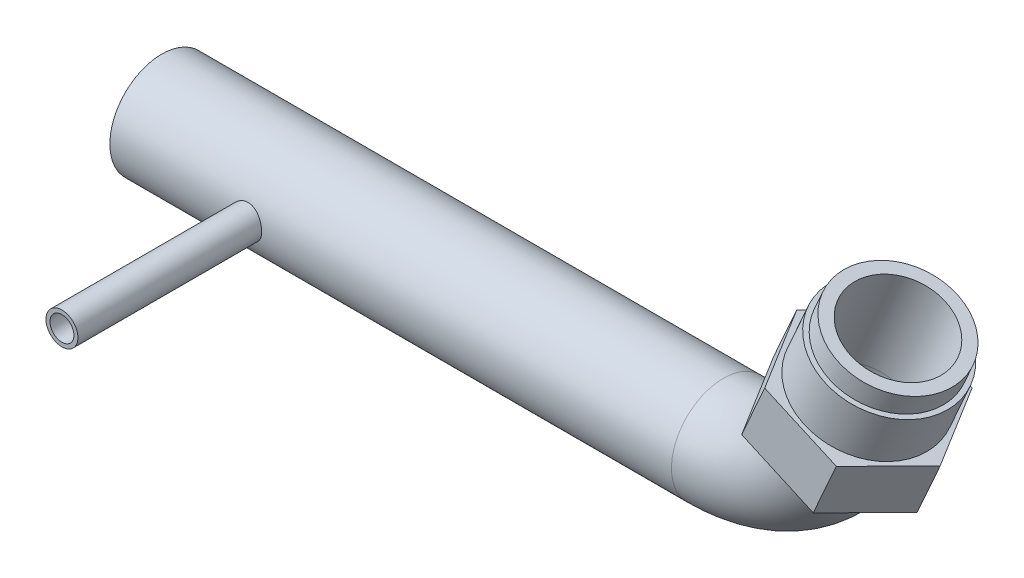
ISO-10303-21;
HEADER;
FILE_DESCRIPTION(('STEP AP214'),'2;1');
FILE_NAME('part.step','',(''),(''),'','','');
FILE_SCHEMA(('AUTOMOTIVE_DESIGN { 1 0 10303 214 1 1 1 1 }'));
ENDSEC;
DATA;
#1=APPLICATION_CONTEXT('core data for automotive mechanical design processes');
#2=APPLICATION_PROTOCOL_DEFINITION('international standard','automotive_design',2000,#1);
#3=PRODUCT_CONTEXT('',#1,'mechanical');
#4=PRODUCT('Part','Part','',(#3));
#5=PRODUCT_RELATED_PRODUCT_CATEGORY('part','',(#4));
#6=PRODUCT_DEFINITION_FORMATION('','',#4);
#7=PRODUCT_DEFINITION_CONTEXT('part definition',#1,'design');
#8=PRODUCT_DEFINITION('design','',#6,#7);
#9=PRODUCT_DEFINITION_SHAPE('','',#8);
#10=(LENGTH_UNIT() NAMED_UNIT(*) SI_UNIT(.MILLI.,.METRE.));
#11=(NAMED_UNIT(*) PLANE_ANGLE_UNIT() SI_UNIT($,.RADIAN.));
#12=(NAMED_UNIT(*) SI_UNIT($,.STERADIAN.) SOLID_ANGLE_UNIT());
#13=UNCERTAINTY_MEASURE_WITH_UNIT(LENGTH_MEASURE(1.E-05),#10,'distance_accuracy_value','');
#14=(GEOMETRIC_REPRESENTATION_CONTEXT(3) GLOBAL_UNCERTAINTY_ASSIGNED_CONTEXT((#13)) GLOBAL_UNIT_ASSIGNED_CONTEXT((#10,
#11,#12)) REPRESENTATION_CONTEXT('',''));
#15=CARTESIAN_POINT('',(0.,0.,0.));
#16=DIRECTION('',(0.,0.,1.));
#17=DIRECTION('',(1.,0.,0.));
#18=AXIS2_PLACEMENT_3D('',#15,#16,#17);
#19=CARTESIAN_POINT('',(85.5792824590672,8.03920002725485,0.));
#20=DIRECTION('',(0.40673664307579,0.913545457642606,0.));
#21=DIRECTION('',(-0.913545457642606,0.40673664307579,0.));
#22=AXIS2_PLACEMENT_3D('',#19,#20,#21);
#23=CYLINDRICAL_SURFACE('',#22,6.99999999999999);
#24=CARTESIAN_POINT('',(88.4671126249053,14.5253727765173,0.));
#25=DIRECTION('',(-0.40673664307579,-0.913545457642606,0.));
#26=DIRECTION('',(0.913545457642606,-0.40673664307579,0.));
#27=AXIS2_PLACEMENT_3D('',#24,#25,#26);
#28=CIRCLE('',#27,6.99999999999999);
#29=CARTESIAN_POINT('',(94.8619308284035,11.6782162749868,0.));
#30=VERTEX_POINT('',#29);
#31=EDGE_CURVE('E11',#30,#30,#28,.F.);
#32=ORIENTED_EDGE('',*,*,#31,.T.);
#33=EDGE_LOOP('',(#32));
#34=FACE_BOUND('',#33,.T.);
#35=CARTESIAN_POINT('',(87.6129656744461,12.6069273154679,0.));
#36=DIRECTION('',(-0.406736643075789,-0.913545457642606,0.));
#37=DIRECTION('',(0.913545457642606,-0.406736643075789,0.));
#38=AXIS2_PLACEMENT_3D('',#35,#36,#37);
#39=CIRCLE('',#38,7.);
#40=CARTESIAN_POINT('',(94.0077838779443,9.75977081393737,0.));
#41=VERTEX_POINT('',#40);
#42=EDGE_CURVE('E464',#41,#41,#39,.T.);
#43=ORIENTED_EDGE('',*,*,#42,.T.);
#44=EDGE_LOOP('',(#43));
#45=FACE_BOUND('',#44,.T.);
#46=ADVANCED_FACE('F32',(#34,#45),#23,.F.);
#47=CARTESIAN_POINT('',(86.7544815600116,10.6787404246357,0.));
#48=DIRECTION('',(0.406736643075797,0.913545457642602,0.));
#49=DIRECTION('',(-0.913545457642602,0.406736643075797,0.));
#50=AXIS2_PLACEMENT_3D('',#47,#48,#49);
#51=CYLINDRICAL_SURFACE('',#50,6.5);
#52=CARTESIAN_POINT('',(86.7544815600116,10.6787404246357,0.));
#53=DIRECTION('',(0.406736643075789,0.913545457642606,0.));
#54=DIRECTION('',(0.,0.,-1.));
#55=AXIS2_PLACEMENT_3D('',#52,#53,#54);
#56=CIRCLE('',#55,6.5);
#57=CARTESIAN_POINT('',(92.6925270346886,8.03495224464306,0.));
#58=VERTEX_POINT('',#57);
#59=EDGE_CURVE('E174',#58,#58,#56,.T.);
#60=ORIENTED_EDGE('',*,*,#59,.T.);
#61=EDGE_LOOP('',(#60));
#62=FACE_BOUND('',#61,.T.);
#63=CARTESIAN_POINT('',(91.0702271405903,20.3720637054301,0.));
#64=DIRECTION('',(0.40673664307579,0.913545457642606,0.));
#65=DIRECTION('',(-0.913545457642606,0.40673664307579,0.));
#66=AXIS2_PLACEMENT_3D('',#63,#64,#65);
#67=CIRCLE('',#66,6.5);
#68=CARTESIAN_POINT('',(85.1321816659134,23.0158518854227,0.));
#69=VERTEX_POINT('',#68);
#70=EDGE_CURVE('E156',#69,#69,#67,.F.);
#71=ORIENTED_EDGE('',*,*,#70,.T.);
#72=EDGE_LOOP('',(#71));
#73=FACE_BOUND('',#72,.T.);
#74=ADVANCED_FACE('F34',(#62,#73),#51,.T.);
#75=CARTESIAN_POINT('',(86.7544815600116,10.6787404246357,0.));
#76=DIRECTION('',(0.406736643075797,0.913545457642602,0.));
#77=DIRECTION('',(-0.913545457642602,0.406736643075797,0.));
#78=AXIS2_PLACEMENT_3D('',#75,#76,#77);
#79=CYLINDRICAL_SURFACE('',#78,5.9);
#80=CARTESIAN_POINT('',(92.1684160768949,22.8386364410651,0.));
#81=DIRECTION('',(0.406736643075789,0.913545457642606,0.));
#82=DIRECTION('',(0.,0.,-1.));
#83=AXIS2_PLACEMENT_3D('',#80,#81,#82);
#84=CIRCLE('',#83,5.9);
#85=CARTESIAN_POINT('',(92.1684160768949,22.8386364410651,-5.9));
#86=VERTEX_POINT('',#85);
#87=EDGE_CURVE('E41',#86,#86,#84,.T.);
#88=ORIENTED_EDGE('',*,*,#87,.T.);
#89=EDGE_LOOP('',(#88));
#90=FACE_BOUND('',#89,.T.);
#91=CARTESIAN_POINT('',(86.7544815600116,10.6787404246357,0.));
#92=DIRECTION('',(0.406736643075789,0.913545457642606,0.));
#93=DIRECTION('',(0.,0.,-1.));
#94=AXIS2_PLACEMENT_3D('',#91,#92,#93);
#95=CIRCLE('',#94,5.9);
#96=CARTESIAN_POINT('',(92.144399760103,8.27899423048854,0.));
#97=VERTEX_POINT('',#96);
#98=EDGE_CURVE('E167',#97,#97,#95,.T.);
#99=ORIENTED_EDGE('',*,*,#98,.F.);
#100=EDGE_LOOP('',(#99));
#101=FACE_BOUND('',#100,.T.);
#102=ADVANCED_FACE('F179',(#90,#101),#79,.F.);
#103=CARTESIAN_POINT('',(70.3106633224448,18.,0.));
#104=DIRECTION('',(0.,0.,1.));
#105=DIRECTION('',(1.,0.,0.));
#106=AXIS2_PLACEMENT_3D('',#103,#104,#105);
#107=TOROIDAL_SURFACE('',#106,18.,6.5);
#108=CARTESIAN_POINT('',(70.3106633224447,0.,0.));
#109=DIRECTION('',(1.,0.,0.));
#110=DIRECTION('',(0.,0.,-1.));
#111=AXIS2_PLACEMENT_3D('',#108,#109,#110);
#112=CIRCLE('',#111,6.5);
#113=CARTESIAN_POINT('',(70.3106633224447,-6.5,0.));
#114=VERTEX_POINT('',#113);
#115=EDGE_CURVE('E163',#114,#114,#112,.T.);
#116=CARTESIAN_POINT('',(70.3106633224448,18.,0.));
#117=DIRECTION('',(0.,0.,1.));
#118=DIRECTION('',(1.,0.,0.));
#119=AXIS2_PLACEMENT_3D('',#116,#117,#118);
#120=CIRCLE('',#119,24.5);
#121=EDGE_CURVE('',#114,#58,#120,.T.);
#122=ORIENTED_EDGE('',*,*,#115,.T.);
#123=ORIENTED_EDGE('',*,*,#59,.F.);
#124=ORIENTED_EDGE('',*,*,#121,.T.);
#125=ORIENTED_EDGE('',*,*,#121,.F.);
#126=EDGE_LOOP('',(#122,#124,#123,#125));
#127=FACE_BOUND('',#126,.T.);
#128=ADVANCED_FACE('F421',(#127),#107,.T.);
#129=CARTESIAN_POINT('',(70.3106633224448,18.,0.));
#130=DIRECTION('',(0.,0.,1.));
#131=DIRECTION('',(1.,0.,0.));
#132=AXIS2_PLACEMENT_3D('',#129,#130,#131);
#133=TOROIDAL_SURFACE('',#132,18.,5.9);
#134=CARTESIAN_POINT('',(70.3106633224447,0.,0.));
#135=DIRECTION('',(1.,0.,0.));
#136=DIRECTION('',(0.,0.,-1.));
#137=AXIS2_PLACEMENT_3D('',#134,#135,#136);
#138=CIRCLE('',#137,5.9);
#139=CARTESIAN_POINT('',(70.3106633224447,-5.9,0.));
#140=VERTEX_POINT('',#139);
#141=EDGE_CURVE('E160',#140,#140,#138,.T.);
#142=CARTESIAN_POINT('',(70.3106633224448,18.,0.));
#143=DIRECTION('',(0.,0.,1.));
#144=DIRECTION('',(1.,0.,0.));
#145=AXIS2_PLACEMENT_3D('',#142,#143,#144);
#146=CIRCLE('',#145,23.9);
#147=EDGE_CURVE('',#140,#97,#146,.T.);
#148=ORIENTED_EDGE('',*,*,#141,.F.);
#149=ORIENTED_EDGE('',*,*,#98,.T.);
#150=ORIENTED_EDGE('',*,*,#147,.T.);
#151=ORIENTED_EDGE('',*,*,#147,.F.);
#152=EDGE_LOOP('',(#148,#150,#149,#151));
#153=FACE_BOUND('',#152,.T.);
#154=ADVANCED_FACE('F415',(#153),#133,.F.);
#155=CARTESIAN_POINT('',(70.3106633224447,0.,0.));
#156=DIRECTION('',(-1.,0.,0.));
#157=DIRECTION('',(0.,0.,1.));
#158=AXIS2_PLACEMENT_3D('',#155,#156,#157);
#159=CYLINDRICAL_SURFACE('',#158,5.9);
#160=CARTESIAN_POINT('',(18.5,0.,5.9));
#161=CARTESIAN_POINT('',(18.4999977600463,0.0828300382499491,5.89999863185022));
#162=CARTESIAN_POINT('',(18.4931161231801,0.165684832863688,5.89823839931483));
#163=CARTESIAN_POINT('',(18.4658144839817,0.329016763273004,5.89138713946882));
#164=CARTESIAN_POINT('',(18.4453870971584,0.409492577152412,5.88629429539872));
#165=CARTESIAN_POINT('',(18.391694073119,0.565684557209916,5.87334130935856));
#166=CARTESIAN_POINT('',(18.3584441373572,0.641406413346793,5.86548455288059));
#167=CARTESIAN_POINT('',(18.2801058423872,0.786197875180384,5.84783888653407));
#168=CARTESIAN_POINT('',(18.2350169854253,0.855267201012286,5.83804989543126));
#169=CARTESIAN_POINT('',(18.1332691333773,0.986260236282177,5.81736852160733));
#170=CARTESIAN_POINT('',(18.0764058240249,1.04802249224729,5.80645865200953));
#171=CARTESIAN_POINT('',(17.9531604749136,1.16124449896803,5.78488032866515));
#172=CARTESIAN_POINT('',(17.886777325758,1.21270304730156,5.77421190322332));
#173=CARTESIAN_POINT('',(17.7451143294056,1.30462316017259,5.75414745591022));
#174=CARTESIAN_POINT('',(17.6697130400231,1.34490284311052,5.74477360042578));
#175=CARTESIAN_POINT('',(17.5129323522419,1.4121517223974,5.72861518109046));
#176=CARTESIAN_POINT('',(17.4315539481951,1.43912312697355,5.72183018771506));
#177=CARTESIAN_POINT('',(17.2669076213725,1.47843656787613,5.71179764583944));
#178=CARTESIAN_POINT('',(17.1837135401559,1.49106951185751,5.70847986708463));
#179=CARTESIAN_POINT('',(17.0163258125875,1.5022537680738,5.70554728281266));
#180=CARTESIAN_POINT('',(16.9321323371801,1.50080745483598,5.70593185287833));
#181=CARTESIAN_POINT('',(16.7673754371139,1.48410606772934,5.71029745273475));
#182=CARTESIAN_POINT('',(16.6867739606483,1.46919896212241,5.71418785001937));
#183=CARTESIAN_POINT('',(16.5292552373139,1.42655478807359,5.72498214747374));
#184=CARTESIAN_POINT('',(16.4523382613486,1.39881677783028,5.73188626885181));
#185=CARTESIAN_POINT('',(16.3034453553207,1.33100488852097,5.74801240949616));
#186=CARTESIAN_POINT('',(16.2315290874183,1.29080579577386,5.75725777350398));
#187=CARTESIAN_POINT('',(16.0953387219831,1.19930036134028,5.77701165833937));
#188=CARTESIAN_POINT('',(16.0310660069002,1.14799201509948,5.78752040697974));
#189=CARTESIAN_POINT('',(15.9099946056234,1.03392786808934,5.80899752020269));
#190=CARTESIAN_POINT('',(15.8534726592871,0.97087877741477,5.81997029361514));
#191=CARTESIAN_POINT('',(15.7517506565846,0.836064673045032,5.84085966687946));
#192=CARTESIAN_POINT('',(15.7065509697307,0.764299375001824,5.85077623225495));
#193=CARTESIAN_POINT('',(15.6286499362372,0.613686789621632,5.86848800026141));
#194=CARTESIAN_POINT('',(15.5959948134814,0.534814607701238,5.87627532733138));
#195=CARTESIAN_POINT('',(15.5444848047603,0.372457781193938,5.888794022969));
#196=CARTESIAN_POINT('',(15.5256271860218,0.288974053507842,5.89352599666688));
#197=CARTESIAN_POINT('',(15.5026730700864,0.122128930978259,5.899310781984));
#198=CARTESIAN_POINT('',(15.4981998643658,0.0388225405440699,5.90045746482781));
#199=CARTESIAN_POINT('',(15.5031065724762,-0.127348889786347,5.89921045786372));
#200=CARTESIAN_POINT('',(15.5124851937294,-0.210213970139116,5.89681709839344));
#201=CARTESIAN_POINT('',(15.5445191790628,-0.371832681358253,5.88881920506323));
#202=CARTESIAN_POINT('',(15.566967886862,-0.450629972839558,5.88326468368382));
#203=CARTESIAN_POINT('',(15.6242677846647,-0.603335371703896,5.86957144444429));
#204=CARTESIAN_POINT('',(15.6591202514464,-0.677242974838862,5.8614324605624));
#205=CARTESIAN_POINT('',(15.7409605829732,-0.819561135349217,5.84324947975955));
#206=CARTESIAN_POINT('',(15.7881579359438,-0.887847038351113,5.83317348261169));
#207=CARTESIAN_POINT('',(15.893081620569,-1.01566287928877,5.81228271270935));
#208=CARTESIAN_POINT('',(15.9508098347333,-1.07519124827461,5.80146780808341));
#209=CARTESIAN_POINT('',(16.0769079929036,-1.18536341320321,5.77997834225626));
#210=CARTESIAN_POINT('',(16.145511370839,-1.23574255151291,5.76931435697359));
#211=CARTESIAN_POINT('',(16.2904196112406,-1.32427465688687,5.74964010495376));
#212=CARTESIAN_POINT('',(16.3667241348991,-1.36242816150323,5.74062976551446));
#213=CARTESIAN_POINT('',(16.524464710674,-1.42514033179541,5.72538357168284));
#214=CARTESIAN_POINT('',(16.6058671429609,-1.44977937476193,5.71913135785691));
#215=CARTESIAN_POINT('',(16.7718431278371,-1.484970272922,5.71009628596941));
#216=CARTESIAN_POINT('',(16.8564159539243,-1.49552533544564,5.70731263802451));
#217=CARTESIAN_POINT('',(17.0236348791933,-1.50207678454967,5.70559153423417));
#218=CARTESIAN_POINT('',(17.1062634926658,-1.49849674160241,5.70654217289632));
#219=CARTESIAN_POINT('',(17.2696972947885,-1.47785227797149,5.71192298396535));
#220=CARTESIAN_POINT('',(17.3505025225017,-1.4607881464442,5.71635308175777));
#221=CARTESIAN_POINT('',(17.5075172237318,-1.41389485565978,5.72813020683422));
#222=CARTESIAN_POINT('',(17.5837526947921,-1.38414770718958,5.73545847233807));
#223=CARTESIAN_POINT('',(17.7302060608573,-1.3127973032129,5.75220828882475));
#224=CARTESIAN_POINT('',(17.8004230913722,-1.27119234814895,5.76163013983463));
#225=CARTESIAN_POINT('',(17.9348870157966,-1.17599044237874,5.78182245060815));
#226=CARTESIAN_POINT('',(17.9989222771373,-1.12210078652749,5.79262238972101));
#227=CARTESIAN_POINT('',(18.1171786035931,-1.00442620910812,5.81418091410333));
#228=CARTESIAN_POINT('',(18.1713973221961,-0.940638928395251,5.82493948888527));
#229=CARTESIAN_POINT('',(18.2694831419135,-0.803524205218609,5.84544595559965));
#230=CARTESIAN_POINT('',(18.3131351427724,-0.730039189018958,5.8551708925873));
#231=CARTESIAN_POINT('',(18.387396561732,-0.576532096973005,5.8722700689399));
#232=CARTESIAN_POINT('',(18.4180150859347,-0.49651463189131,5.87964594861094));
#233=CARTESIAN_POINT('',(18.4609314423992,-0.347230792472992,5.89015920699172));
#234=CARTESIAN_POINT('',(18.4755499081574,-0.278659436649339,5.89382377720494));
#235=CARTESIAN_POINT('',(18.4950847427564,-0.140064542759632,5.89874465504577));
#236=CARTESIAN_POINT('',(18.500001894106,-0.0700411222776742,5.90000115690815));
#237=CARTESIAN_POINT('',(18.5,0.,5.9));
#238=B_SPLINE_CURVE_WITH_KNOTS('',3,(#160,#161,#162,#163,#164,#165,#166,#167,#168,#169,#170,
#171,#172,#173,#174,#175,#176,#177,#178,#179,#180,#181,#182,#183,#184,#185,#186,#187,#188,#189,
#190,#191,#192,#193,#194,#195,#196,#197,#198,#199,#200,#201,#202,#203,#204,#205,#206,#207,#208,
#209,#210,#211,#212,#213,#214,#215,#216,#217,#218,#219,#220,#221,#222,#223,#224,#225,#226,#227,
#228,#229,#230,#231,#232,#233,#234,#235,#236,#237),.UNSPECIFIED.,.T.,.F.,(4,2,2,2,2,2,2,2,2,2,2,
2,2,2,2,2,2,2,2,2,2,2,2,2,2,2,2,2,2,2,2,2,2,2,2,2,2,2,4),(0.,0.248233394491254,
0.496602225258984,0.744667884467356,0.992743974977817,1.2455526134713,1.49839073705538,
1.75512908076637,2.01182480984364,2.26321383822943,2.51456046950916,2.7595900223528,
3.00463756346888,3.25223194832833,3.4998710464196,3.75482258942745,4.00978245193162,
4.26567297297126,4.52151279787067,4.77059551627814,5.01965499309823,5.26487950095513,
5.51012925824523,5.7598463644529,6.00960815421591,6.26572614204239,6.52183286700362,
6.77639940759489,7.03090796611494,7.27784869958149,7.52478413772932,7.77014649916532,
8.01554404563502,8.26754847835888,8.51961307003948,8.77644345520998,9.03309410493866,
9.24301732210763,9.45292360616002),.UNSPECIFIED.);
#239=CARTESIAN_POINT('',(18.5,0.,5.9));
#240=VERTEX_POINT('',#239);
#241=EDGE_CURVE('E471',#240,#240,#238,.T.);
#242=ORIENTED_EDGE('',*,*,#241,.T.);
#243=EDGE_LOOP('',(#242));
#244=FACE_BOUND('',#243,.T.);
#245=ORIENTED_EDGE('',*,*,#141,.T.);
#246=EDGE_LOOP('',(#245));
#247=FACE_BOUND('',#246,.T.);
#248=CARTESIAN_POINT('',(0.,0.,0.));
#249=DIRECTION('',(1.,0.,0.));
#250=DIRECTION('',(0.,0.,-1.));
#251=AXIS2_PLACEMENT_3D('',#248,#249,#250);
#252=CIRCLE('',#251,5.9);
#253=CARTESIAN_POINT('',(0.,0.,-5.9));
#254=VERTEX_POINT('',#253);
#255=EDGE_CURVE('E159',#254,#254,#252,.T.);
#256=ORIENTED_EDGE('',*,*,#255,.F.);
#257=EDGE_LOOP('',(#256));
#258=FACE_BOUND('',#257,.T.);
#259=ADVANCED_FACE('F420',(#244,#247,#258),#159,.F.);
#260=CARTESIAN_POINT('',(70.3106633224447,0.,0.));
#261=DIRECTION('',(-1.,0.,0.));
#262=DIRECTION('',(0.,0.,1.));
#263=AXIS2_PLACEMENT_3D('',#260,#261,#262);
#264=CYLINDRICAL_SURFACE('',#263,6.5);
#265=CARTESIAN_POINT('',(19.,0.,6.5));
#266=CARTESIAN_POINT('',(18.999999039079,0.10958647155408,6.49999929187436));
#267=CARTESIAN_POINT('',(18.9909633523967,0.219182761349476,6.49720235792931));
#268=CARTESIAN_POINT('',(18.9551505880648,0.435175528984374,6.48631855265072));
#269=CARTESIAN_POINT('',(18.9283690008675,0.541571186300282,6.47823033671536));
#270=CARTESIAN_POINT('',(18.8580492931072,0.748016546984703,6.45764858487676));
#271=CARTESIAN_POINT('',(18.8145366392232,0.848075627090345,6.44516174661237));
#272=CARTESIAN_POINT('',(18.7120967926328,1.03947745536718,6.4170753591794));
#273=CARTESIAN_POINT('',(18.6531673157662,1.13081890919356,6.40147534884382));
#274=CARTESIAN_POINT('',(18.5197023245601,1.30493699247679,6.36829752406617));
#275=CARTESIAN_POINT('',(18.4447875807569,1.38741488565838,6.35067760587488));
#276=CARTESIAN_POINT('',(18.282286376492,1.53885708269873,6.31569252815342));
#277=CARTESIAN_POINT('',(18.1946976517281,1.60781896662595,6.29832741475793));
#278=CARTESIAN_POINT('',(18.0067713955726,1.73187276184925,6.26536877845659));
#279=CARTESIAN_POINT('',(17.9061797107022,1.78659481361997,6.24982736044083));
#280=CARTESIAN_POINT('',(17.6966660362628,1.8782224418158,6.22290748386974));
#281=CARTESIAN_POINT('',(17.5877461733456,1.91513254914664,6.21152796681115));
#282=CARTESIAN_POINT('',(17.3680326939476,1.96900160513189,6.19466009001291));
#283=CARTESIAN_POINT('',(17.2573874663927,1.9865133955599,6.18900890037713));
#284=CARTESIAN_POINT('',(17.0345962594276,2.00281555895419,6.1837537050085));
#285=CARTESIAN_POINT('',(16.9224506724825,2.00161073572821,6.18414814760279));
#286=CARTESIAN_POINT('',(16.7043849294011,1.98094698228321,6.19079569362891));
#287=CARTESIAN_POINT('',(16.5983905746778,1.96218684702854,6.19682450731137));
#288=CARTESIAN_POINT('',(16.3911333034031,1.90807645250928,6.2136977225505));
#289=CARTESIAN_POINT('',(16.2898708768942,1.87272447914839,6.22454262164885));
#290=CARTESIAN_POINT('',(16.093269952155,1.78593221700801,6.2500007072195));
#291=CARTESIAN_POINT('',(15.9980365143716,1.73426970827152,6.2646654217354));
#292=CARTESIAN_POINT('',(15.8173594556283,1.61647725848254,6.29608673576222));
#293=CARTESIAN_POINT('',(15.7319183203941,1.55034365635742,6.31284386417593));
#294=CARTESIAN_POINT('',(15.5692956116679,1.40204114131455,6.34746551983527));
#295=CARTESIAN_POINT('',(15.4926437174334,1.31929416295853,6.36534631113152));
#296=CARTESIAN_POINT('',(15.3541777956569,1.14189770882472,6.39954830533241));
#297=CARTESIAN_POINT('',(15.2923648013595,1.04724740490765,6.4158693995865));
#298=CARTESIAN_POINT('',(15.1849870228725,0.847732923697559,6.44527556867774));
#299=CARTESIAN_POINT('',(15.1395451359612,0.74279871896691,6.45833594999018));
#300=CARTESIAN_POINT('',(15.0671137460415,0.526280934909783,6.47957102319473));
#301=CARTESIAN_POINT('',(15.0401188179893,0.414699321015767,6.48774715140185));
#302=CARTESIAN_POINT('',(15.0062419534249,0.192552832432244,6.49806290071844));
#303=CARTESIAN_POINT('',(14.9986426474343,0.0821071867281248,6.50041772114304));
#304=CARTESIAN_POINT('',(15.001754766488,-0.138491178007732,6.49946000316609));
#305=CARTESIAN_POINT('',(15.0124636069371,-0.248643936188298,6.49614826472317));
#306=CARTESIAN_POINT('',(15.0513104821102,-0.46278580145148,6.48437074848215));
#307=CARTESIAN_POINT('',(15.0790246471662,-0.566859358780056,6.47603039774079));
#308=CARTESIAN_POINT('',(15.1505810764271,-0.768852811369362,6.45516726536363));
#309=CARTESIAN_POINT('',(15.1944253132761,-0.86677195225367,6.44264397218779));
#310=CARTESIAN_POINT('',(15.2981711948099,-1.05627961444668,6.41433382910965));
#311=CARTESIAN_POINT('',(15.3584316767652,-1.14766081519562,6.39847611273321));
#312=CARTESIAN_POINT('',(15.4928668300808,-1.31925606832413,6.36531333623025));
#313=CARTESIAN_POINT('',(15.567045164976,-1.39946717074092,6.34800789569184));
#314=CARTESIAN_POINT('',(15.730583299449,-1.54963528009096,6.31306645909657));
#315=CARTESIAN_POINT('',(15.8204160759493,-1.61908131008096,6.29544322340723));
#316=CARTESIAN_POINT('',(16.0108433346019,-1.74195487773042,6.2625596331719));
#317=CARTESIAN_POINT('',(16.1114375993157,-1.79538273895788,6.24729923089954));
#318=CARTESIAN_POINT('',(16.320278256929,-1.88435707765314,6.22104126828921));
#319=CARTESIAN_POINT('',(16.428490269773,-1.9199786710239,6.21002584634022));
#320=CARTESIAN_POINT('',(16.6497826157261,-1.97237526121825,6.19358575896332));
#321=CARTESIAN_POINT('',(16.762861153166,-1.98915714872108,6.18815904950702));
#322=CARTESIAN_POINT('',(16.9853480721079,-2.00291323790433,6.18371932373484));
#323=CARTESIAN_POINT('',(17.0947000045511,-2.00072360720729,6.18443554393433));
#324=CARTESIAN_POINT('',(17.3113978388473,-1.97860856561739,6.19154584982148));
#325=CARTESIAN_POINT('',(17.4187438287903,-1.95868393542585,6.19793968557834));
#326=CARTESIAN_POINT('',(17.6269374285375,-1.90221657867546,6.21549850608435));
#327=CARTESIAN_POINT('',(17.7278541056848,-1.86590616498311,6.22659666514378));
#328=CARTESIAN_POINT('',(17.9222435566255,-1.77788001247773,6.2522984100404));
#329=CARTESIAN_POINT('',(18.0157148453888,-1.72616121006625,6.26690269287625));
#330=CARTESIAN_POINT('',(18.1964125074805,-1.60648172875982,6.29866516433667));
#331=CARTESIAN_POINT('',(18.2832654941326,-1.53797752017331,6.31589943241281));
#332=CARTESIAN_POINT('',(18.4445140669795,-1.38763671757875,6.35062263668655));
#333=CARTESIAN_POINT('',(18.5189063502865,-1.30579660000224,6.36811163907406));
#334=CARTESIAN_POINT('',(18.6554491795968,-1.12802317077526,6.40203042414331));
#335=CARTESIAN_POINT('',(18.7171435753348,-1.03172886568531,6.41840990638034));
#336=CARTESIAN_POINT('',(18.8233844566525,-0.829631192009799,6.44764383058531));
#337=CARTESIAN_POINT('',(18.867938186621,-0.723831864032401,6.46049976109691));
#338=CARTESIAN_POINT('',(18.9351007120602,-0.515929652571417,6.48025348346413));
#339=CARTESIAN_POINT('',(18.9593694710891,-0.414403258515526,6.48759534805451));
#340=CARTESIAN_POINT('',(18.9918180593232,-0.208587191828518,6.49746849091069));
#341=CARTESIAN_POINT('',(19.0000009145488,-0.104298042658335,6.50000067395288));
#342=CARTESIAN_POINT('',(19.,0.,6.5));
#343=B_SPLINE_CURVE_WITH_KNOTS('',3,(#265,#266,#267,#268,#269,#270,#271,#272,#273,#274,#275,
#276,#277,#278,#279,#280,#281,#282,#283,#284,#285,#286,#287,#288,#289,#290,#291,#292,#293,#294,
#295,#296,#297,#298,#299,#300,#301,#302,#303,#304,#305,#306,#307,#308,#309,#310,#311,#312,#313,
#314,#315,#316,#317,#318,#319,#320,#321,#322,#323,#324,#325,#326,#327,#328,#329,#330,#331,#332,
#333,#334,#335,#336,#337,#338,#339,#340,#341,#342),.UNSPECIFIED.,.T.,.F.,(4,2,2,2,2,2,2,2,2,2,2,
2,2,2,2,2,2,2,2,2,2,2,2,2,2,2,2,2,2,2,2,2,2,2,2,2,2,2,4),(0.,0.328376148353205,
0.656835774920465,0.984797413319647,1.31280767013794,1.64969601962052,1.98664463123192,
2.33162619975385,2.67651996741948,3.0113091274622,3.34601236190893,3.66793485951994,
3.98989062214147,4.31643724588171,4.64306657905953,4.98408507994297,5.32512731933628,
5.66867887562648,6.01212935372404,6.34267966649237,6.67318331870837,6.99576592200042,
7.31838798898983,7.64872325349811,7.97914559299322,8.32223487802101,8.66531723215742,
9.00693981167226,9.34843740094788,9.67496275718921,10.0014737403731,10.3234943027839,
10.6455789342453,10.9799294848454,11.3143685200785,11.659277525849,12.0040405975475,
12.3166287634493,12.6291581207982),.UNSPECIFIED.);
#344=CARTESIAN_POINT('',(19.,0.,6.5));
#345=VERTEX_POINT('',#344);
#346=EDGE_CURVE('E453',#345,#345,#343,.T.);
#347=ORIENTED_EDGE('',*,*,#346,.F.);
#348=EDGE_LOOP('',(#347));
#349=FACE_BOUND('',#348,.T.);
#350=ORIENTED_EDGE('',*,*,#115,.F.);
#351=EDGE_LOOP('',(#350));
#352=FACE_BOUND('',#351,.T.);
#353=CARTESIAN_POINT('',(0.,0.,0.));
#354=DIRECTION('',(1.,0.,0.));
#355=DIRECTION('',(0.,0.,-1.));
#356=AXIS2_PLACEMENT_3D('',#353,#354,#355);
#357=CIRCLE('',#356,6.5);
#358=CARTESIAN_POINT('',(0.,0.,-6.5));
#359=VERTEX_POINT('',#358);
#360=EDGE_CURVE('E164',#359,#359,#357,.T.);
#361=ORIENTED_EDGE('',*,*,#360,.T.);
#362=EDGE_LOOP('',(#361));
#363=FACE_BOUND('',#362,.T.);
#364=ADVANCED_FACE('F186',(#349,#352,#363),#264,.T.);
#365=CARTESIAN_POINT('',(92.1684160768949,22.8386364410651,0.));
#366=DIRECTION('',(0.406736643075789,0.913545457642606,0.));
#367=DIRECTION('',(0.,0.,-1.));
#368=AXIS2_PLACEMENT_3D('',#365,#366,#367);
#369=PLANE('',#368);
#370=ORIENTED_EDGE('',*,*,#87,.F.);
#371=EDGE_LOOP('',(#370));
#372=FACE_BOUND('',#371,.T.);
#373=CARTESIAN_POINT('',(92.1684160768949,22.8386364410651,0.));
#374=DIRECTION('',(0.40673664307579,0.913545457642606,0.));
#375=DIRECTION('',(-0.913545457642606,0.40673664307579,0.));
#376=AXIS2_PLACEMENT_3D('',#373,#374,#375);
#377=CIRCLE('',#376,7.39999999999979);
#378=CARTESIAN_POINT('',(85.4081796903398,25.8484875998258,0.));
#379=VERTEX_POINT('',#378);
#380=EDGE_CURVE('E153',#379,#379,#377,.T.);
#381=ORIENTED_EDGE('',*,*,#380,.T.);
#382=EDGE_LOOP('',(#381));
#383=FACE_BOUND('',#382,.T.);
#384=ADVANCED_FACE('F182',(#372,#383),#369,.T.);
#385=CARTESIAN_POINT('',(0.,0.,0.));
#386=DIRECTION('',(1.,0.,0.));
#387=DIRECTION('',(0.,0.,-1.));
#388=AXIS2_PLACEMENT_3D('',#385,#386,#387);
#389=PLANE('',#388);
#390=ORIENTED_EDGE('',*,*,#255,.T.);
#391=EDGE_LOOP('',(#390));
#392=FACE_BOUND('',#391,.T.);
#393=ORIENTED_EDGE('',*,*,#360,.F.);
#394=EDGE_LOOP('',(#393));
#395=FACE_BOUND('',#394,.T.);
#396=ADVANCED_FACE('F185',(#392,#395),#389,.F.);
#397=CARTESIAN_POINT('',(91.0702271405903,20.37206370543,0.));
#398=DIRECTION('',(0.40673664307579,0.913545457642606,0.));
#399=DIRECTION('',(-0.913545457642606,0.40673664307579,0.));
#400=AXIS2_PLACEMENT_3D('',#397,#398,#399);
#401=CYLINDRICAL_SURFACE('',#400,7.39999999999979);
#402=CARTESIAN_POINT('',(91.0702271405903,20.37206370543,0.));
#403=DIRECTION('',(-0.40673664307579,-0.913545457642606,0.));
#404=DIRECTION('',(0.913545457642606,-0.40673664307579,0.));
#405=AXIS2_PLACEMENT_3D('',#402,#403,#404);
#406=CIRCLE('',#405,7.39999999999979);
#407=CARTESIAN_POINT('',(97.8304635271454,17.3622125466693,0.));
#408=VERTEX_POINT('',#407);
#409=EDGE_CURVE('E148',#408,#408,#406,.F.);
#410=ORIENTED_EDGE('',*,*,#409,.T.);
#411=EDGE_LOOP('',(#410));
#412=FACE_BOUND('',#411,.T.);
#413=ORIENTED_EDGE('',*,*,#380,.F.);
#414=EDGE_LOOP('',(#413));
#415=FACE_BOUND('',#414,.T.);
#416=ADVANCED_FACE('F190',(#412,#415),#401,.T.);
#417=CARTESIAN_POINT('',(91.0702271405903,20.37206370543,0.));
#418=DIRECTION('',(0.40673664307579,0.913545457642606,0.));
#419=DIRECTION('',(-0.913545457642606,0.40673664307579,0.));
#420=AXIS2_PLACEMENT_3D('',#417,#418,#419);
#421=PLANE('',#420);
#422=CARTESIAN_POINT('',(91.0702271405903,20.37206370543,0.));
#423=DIRECTION('',(-0.40673664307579,-0.913545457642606,0.));
#424=DIRECTION('',(0.913545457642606,-0.40673664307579,0.));
#425=AXIS2_PLACEMENT_3D('',#422,#423,#424);
#426=CIRCLE('',#425,6.55);
#427=CARTESIAN_POINT('',(97.0539498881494,17.7079386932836,0.));
#428=VERTEX_POINT('',#427);
#429=EDGE_CURVE('E138',#428,#428,#426,.T.);
#430=ORIENTED_EDGE('',*,*,#429,.T.);
#431=EDGE_LOOP('',(#430));
#432=FACE_BOUND('',#431,.T.);
#433=ORIENTED_EDGE('',*,*,#70,.F.);
#434=EDGE_LOOP('',(#433));
#435=FACE_BOUND('',#434,.T.);
#436=ADVANCED_FACE('F192',(#432,#435),#421,.F.);
#437=CARTESIAN_POINT('',(88.4671126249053,14.5253727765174,0.));
#438=DIRECTION('',(-0.40673664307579,-0.913545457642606,0.));
#439=DIRECTION('',(0.913545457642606,-0.40673664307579,0.));
#440=AXIS2_PLACEMENT_3D('',#437,#438,#439);
#441=PLANE('',#440);
#442=ORIENTED_EDGE('',*,*,#31,.F.);
#443=EDGE_LOOP('',(#442));
#444=FACE_BOUND('',#443,.T.);
#445=CARTESIAN_POINT('',(88.4671126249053,14.5253727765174,0.));
#446=DIRECTION('',(-0.40673664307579,-0.913545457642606,0.));
#447=DIRECTION('',(0.913545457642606,-0.40673664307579,0.));
#448=AXIS2_PLACEMENT_3D('',#445,#446,#447);
#449=CIRCLE('',#448,6.55);
#450=CARTESIAN_POINT('',(94.4508353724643,11.8612477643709,0.));
#451=VERTEX_POINT('',#450);
#452=EDGE_CURVE('E139',#451,#451,#449,.T.);
#453=ORIENTED_EDGE('',*,*,#452,.F.);
#454=EDGE_LOOP('',(#453));
#455=FACE_BOUND('',#454,.T.);
#456=ADVANCED_FACE('F199',(#444,#455),#441,.T.);
#457=CARTESIAN_POINT('',(91.0702271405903,20.37206370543,0.));
#458=DIRECTION('',(-0.40673664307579,-0.913545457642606,0.));
#459=DIRECTION('',(0.913545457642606,-0.40673664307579,0.));
#460=AXIS2_PLACEMENT_3D('',#457,#458,#459);
#461=PLANE('',#460);
#462=ORIENTED_EDGE('',*,*,#409,.F.);
#463=EDGE_LOOP('',(#462));
#464=FACE_BOUND('',#463,.T.);
#465=CARTESIAN_POINT('',(91.0702271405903,20.37206370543,0.));
#466=DIRECTION('',(-0.40673664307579,-0.913545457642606,0.));
#467=DIRECTION('',(0.913545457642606,-0.40673664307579,0.));
#468=AXIS2_PLACEMENT_3D('',#465,#466,#467);
#469=CIRCLE('',#468,8.00000000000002);
#470=CARTESIAN_POINT('',(98.3785908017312,17.1181705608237,0.));
#471=VERTEX_POINT('',#470);
#472=EDGE_CURVE('E142',#471,#471,#469,.T.);
#473=ORIENTED_EDGE('',*,*,#472,.F.);
#474=EDGE_LOOP('',(#473));
#475=FACE_BOUND('',#474,.T.);
#476=ADVANCED_FACE('F248',(#464,#475),#461,.F.);
#477=CARTESIAN_POINT('',(88.4671126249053,14.5253727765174,0.));
#478=DIRECTION('',(0.40673664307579,0.913545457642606,0.));
#479=DIRECTION('',(-0.913545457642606,0.40673664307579,0.));
#480=AXIS2_PLACEMENT_3D('',#477,#478,#479);
#481=CYLINDRICAL_SURFACE('',#480,8.00000000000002);
#482=CARTESIAN_POINT('',(88.4671126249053,14.5253727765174,0.));
#483=DIRECTION('',(-0.40673664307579,-0.913545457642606,0.));
#484=DIRECTION('',(0.913545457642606,-0.40673664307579,0.));
#485=AXIS2_PLACEMENT_3D('',#482,#483,#484);
#486=CIRCLE('',#485,8.00000000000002);
#487=CARTESIAN_POINT('',(95.7754762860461,11.271479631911,0.));
#488=VERTEX_POINT('',#487);
#489=EDGE_CURVE('E145',#488,#488,#486,.T.);
#490=ORIENTED_EDGE('',*,*,#489,.F.);
#491=EDGE_LOOP('',(#490));
#492=FACE_BOUND('',#491,.T.);
#493=ORIENTED_EDGE('',*,*,#472,.T.);
#494=EDGE_LOOP('',(#493));
#495=FACE_BOUND('',#494,.T.);
#496=ADVANCED_FACE('F244',(#492,#495),#481,.T.);
#497=CARTESIAN_POINT('',(88.4671126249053,14.5253727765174,0.));
#498=DIRECTION('',(0.40673664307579,0.913545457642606,0.));
#499=DIRECTION('',(-0.913545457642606,0.40673664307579,0.));
#500=AXIS2_PLACEMENT_3D('',#497,#498,#499);
#501=CYLINDRICAL_SURFACE('',#500,6.55);
#502=ORIENTED_EDGE('',*,*,#452,.T.);
#503=EDGE_LOOP('',(#502));
#504=FACE_BOUND('',#503,.T.);
#505=ORIENTED_EDGE('',*,*,#429,.F.);
#506=EDGE_LOOP('',(#505));
#507=FACE_BOUND('',#506,.T.);
#508=ADVANCED_FACE('F223',(#504,#507),#501,.F.);
#509=CARTESIAN_POINT('',(97.4335197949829,10.5332711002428,0.));
#510=DIRECTION('',(-0.406736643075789,-0.913545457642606,0.));
#511=DIRECTION('',(0.913545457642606,-0.406736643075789,0.));
#512=AXIS2_PLACEMENT_3D('',#509,#510,#511);
#513=PLANE('',#512);
#514=DIRECTION('',(0.456772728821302,-0.203368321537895,0.866025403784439));
#515=VECTOR('',#514,1.);
#516=CARTESIAN_POINT('',(92.9503162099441,12.5293219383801,-8.50000000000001));
#517=LINE('',#516,#515);
#518=CARTESIAN_POINT('',(92.9503162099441,12.5293219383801,-8.50000000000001));
#519=VERTEX_POINT('',#518);
#520=CARTESIAN_POINT('',(97.4335197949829,10.5332711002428,0.));
#521=VERTEX_POINT('',#520);
#522=EDGE_CURVE('E118',#519,#521,#517,.T.);
#523=ORIENTED_EDGE('',*,*,#522,.F.);
#524=DIRECTION('',(0.913545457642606,-0.406736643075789,0.));
#525=VECTOR('',#524,1.);
#526=CARTESIAN_POINT('',(83.9839090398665,16.5214236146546,-8.50000000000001));
#527=LINE('',#526,#525);
#528=CARTESIAN_POINT('',(83.9839090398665,16.5214236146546,-8.50000000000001));
#529=VERTEX_POINT('',#528);
#530=EDGE_CURVE('E78',#529,#519,#527,.T.);
#531=ORIENTED_EDGE('',*,*,#530,.F.);
#532=DIRECTION('',(0.456772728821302,-0.203368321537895,-0.866025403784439));
#533=VECTOR('',#532,1.);
#534=CARTESIAN_POINT('',(79.5007054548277,18.5174744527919,0.));
#535=LINE('',#534,#533);
#536=CARTESIAN_POINT('',(79.5007054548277,18.5174744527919,0.));
#537=VERTEX_POINT('',#536);
#538=EDGE_CURVE('E72',#537,#529,#535,.T.);
#539=ORIENTED_EDGE('',*,*,#538,.F.);
#540=DIRECTION('',(-0.456772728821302,0.203368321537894,-0.866025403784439));
#541=VECTOR('',#540,1.);
#542=CARTESIAN_POINT('',(83.9839090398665,16.5214236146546,8.50000000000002));
#543=LINE('',#542,#541);
#544=CARTESIAN_POINT('',(83.9839090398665,16.5214236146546,8.50000000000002));
#545=VERTEX_POINT('',#544);
#546=EDGE_CURVE('E108',#545,#537,#543,.T.);
#547=ORIENTED_EDGE('',*,*,#546,.F.);
#548=DIRECTION('',(-0.913545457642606,0.40673664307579,0.));
#549=VECTOR('',#548,1.);
#550=CARTESIAN_POINT('',(92.9503162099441,12.5293219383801,8.50000000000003));
#551=LINE('',#550,#549);
#552=CARTESIAN_POINT('',(92.9503162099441,12.5293219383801,8.50000000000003));
#553=VERTEX_POINT('',#552);
#554=EDGE_CURVE('E124',#553,#545,#551,.T.);
#555=ORIENTED_EDGE('',*,*,#554,.F.);
#556=DIRECTION('',(-0.456772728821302,0.203368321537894,0.866025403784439));
#557=VECTOR('',#556,1.);
#558=CARTESIAN_POINT('',(97.4335197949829,10.5332711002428,0.));
#559=LINE('',#558,#557);
#560=EDGE_CURVE('E121',#521,#553,#559,.T.);
#561=ORIENTED_EDGE('',*,*,#560,.F.);
#562=EDGE_LOOP('',(#523,#531,#539,#547,#555,#561));
#563=FACE_BOUND('',#562,.T.);
#564=ORIENTED_EDGE('',*,*,#489,.T.);
#565=EDGE_LOOP('',(#564));
#566=FACE_BOUND('',#565,.T.);
#567=ADVANCED_FACE('F219',(#563,#566),#513,.F.);
#568=CARTESIAN_POINT('',(94.5456896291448,4.04709835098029,0.));
#569=DIRECTION('',(-0.406736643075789,-0.913545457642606,0.));
#570=DIRECTION('',(0.913545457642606,-0.406736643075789,0.));
#571=AXIS2_PLACEMENT_3D('',#568,#569,#570);
#572=PLANE('',#571);
#573=CARTESIAN_POINT('',(85.5792824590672,8.03920002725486,0.));
#574=DIRECTION('',(-0.406736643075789,-0.913545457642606,0.));
#575=DIRECTION('',(0.913545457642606,-0.406736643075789,0.));
#576=AXIS2_PLACEMENT_3D('',#573,#574,#575);
#577=CIRCLE('',#576,7.75000000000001);
#578=CARTESIAN_POINT('',(92.6592597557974,4.88699104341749,0.));
#579=VERTEX_POINT('',#578);
#580=EDGE_CURVE('E468',#579,#579,#577,.T.);
#581=ORIENTED_EDGE('',*,*,#580,.F.);
#582=EDGE_LOOP('',(#581));
#583=FACE_BOUND('',#582,.T.);
#584=DIRECTION('',(0.456772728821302,-0.203368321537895,0.866025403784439));
#585=VECTOR('',#584,1.);
#586=CARTESIAN_POINT('',(90.062486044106,6.04314918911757,-8.50000000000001));
#587=LINE('',#586,#585);
#588=CARTESIAN_POINT('',(90.062486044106,6.04314918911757,-8.50000000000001));
#589=VERTEX_POINT('',#588);
#590=CARTESIAN_POINT('',(94.5456896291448,4.04709835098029,0.));
#591=VERTEX_POINT('',#590);
#592=EDGE_CURVE('E129',#589,#591,#587,.T.);
#593=ORIENTED_EDGE('',*,*,#592,.T.);
#594=DIRECTION('',(-0.456772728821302,0.203368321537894,0.866025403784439));
#595=VECTOR('',#594,1.);
#596=CARTESIAN_POINT('',(94.5456896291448,4.04709835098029,0.));
#597=LINE('',#596,#595);
#598=CARTESIAN_POINT('',(90.062486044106,6.04314918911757,8.50000000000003));
#599=VERTEX_POINT('',#598);
#600=EDGE_CURVE('E87',#591,#599,#597,.T.);
#601=ORIENTED_EDGE('',*,*,#600,.T.);
#602=DIRECTION('',(-0.913545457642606,0.40673664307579,0.));
#603=VECTOR('',#602,1.);
#604=CARTESIAN_POINT('',(90.062486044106,6.04314918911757,8.50000000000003));
#605=LINE('',#604,#603);
#606=CARTESIAN_POINT('',(81.0960788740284,10.0352508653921,8.50000000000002));
#607=VERTEX_POINT('',#606);
#608=EDGE_CURVE('E100',#599,#607,#605,.T.);
#609=ORIENTED_EDGE('',*,*,#608,.T.);
#610=DIRECTION('',(-0.456772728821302,0.203368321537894,-0.866025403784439));
#611=VECTOR('',#610,1.);
#612=CARTESIAN_POINT('',(81.0960788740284,10.0352508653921,8.50000000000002));
#613=LINE('',#612,#611);
#614=CARTESIAN_POINT('',(76.6128752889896,12.0313017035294,0.));
#615=VERTEX_POINT('',#614);
#616=EDGE_CURVE('E94',#607,#615,#613,.T.);
#617=ORIENTED_EDGE('',*,*,#616,.T.);
#618=DIRECTION('',(0.456772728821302,-0.203368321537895,-0.866025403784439));
#619=VECTOR('',#618,1.);
#620=CARTESIAN_POINT('',(76.6128752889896,12.0313017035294,0.));
#621=LINE('',#620,#619);
#622=CARTESIAN_POINT('',(81.0960788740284,10.0352508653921,-8.50000000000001));
#623=VERTEX_POINT('',#622);
#624=EDGE_CURVE('E98',#615,#623,#621,.T.);
#625=ORIENTED_EDGE('',*,*,#624,.T.);
#626=DIRECTION('',(0.913545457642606,-0.406736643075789,0.));
#627=VECTOR('',#626,1.);
#628=CARTESIAN_POINT('',(81.0960788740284,10.0352508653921,-8.50000000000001));
#629=LINE('',#628,#627);
#630=EDGE_CURVE('E49',#623,#589,#629,.T.);
#631=ORIENTED_EDGE('',*,*,#630,.T.);
#632=EDGE_LOOP('',(#593,#601,#609,#617,#625,#631));
#633=FACE_BOUND('',#632,.T.);
#634=ADVANCED_FACE('F96',(#583,#633),#572,.T.);
#635=CARTESIAN_POINT('',(90.062486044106,6.04314918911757,-8.50000000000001));
#636=DIRECTION('',(-0.791153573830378,0.352244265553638,0.499999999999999));
#637=DIRECTION('',(0.534240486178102,0.,0.845332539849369));
#638=AXIS2_PLACEMENT_3D('',#635,#636,#637);
#639=PLANE('',#638);
#640=ORIENTED_EDGE('',*,*,#522,.T.);
#641=DIRECTION('',(0.40673664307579,0.913545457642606,0.));
#642=VECTOR('',#641,1.);
#643=CARTESIAN_POINT('',(94.5456896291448,4.04709835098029,0.));
#644=LINE('',#643,#642);
#645=EDGE_CURVE('E136',#591,#521,#644,.T.);
#646=ORIENTED_EDGE('',*,*,#645,.F.);
#647=ORIENTED_EDGE('',*,*,#592,.F.);
#648=DIRECTION('',(0.40673664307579,0.913545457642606,0.));
#649=VECTOR('',#648,1.);
#650=CARTESIAN_POINT('',(90.062486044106,6.04314918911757,-8.50000000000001));
#651=LINE('',#650,#649);
#652=EDGE_CURVE('E114',#589,#519,#651,.T.);
#653=ORIENTED_EDGE('',*,*,#652,.T.);
#654=EDGE_LOOP('',(#640,#646,#647,#653));
#655=FACE_BOUND('',#654,.T.);
#656=ADVANCED_FACE('F218',(#655),#639,.F.);
#657=CARTESIAN_POINT('',(94.5456896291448,4.04709835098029,0.));
#658=DIRECTION('',(-0.791153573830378,0.352244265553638,-0.499999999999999));
#659=DIRECTION('',(-0.534240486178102,0.,0.845332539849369));
#660=AXIS2_PLACEMENT_3D('',#657,#658,#659);
#661=PLANE('',#660);
#662=ORIENTED_EDGE('',*,*,#560,.T.);
#663=DIRECTION('',(0.40673664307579,0.913545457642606,0.));
#664=VECTOR('',#663,1.);
#665=CARTESIAN_POINT('',(90.062486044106,6.04314918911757,8.50000000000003));
#666=LINE('',#665,#664);
#667=EDGE_CURVE('E133',#599,#553,#666,.T.);
#668=ORIENTED_EDGE('',*,*,#667,.F.);
#669=ORIENTED_EDGE('',*,*,#600,.F.);
#670=ORIENTED_EDGE('',*,*,#645,.T.);
#671=EDGE_LOOP('',(#662,#668,#669,#670));
#672=FACE_BOUND('',#671,.T.);
#673=ADVANCED_FACE('F235',(#672),#661,.F.);
#674=CARTESIAN_POINT('',(90.062486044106,6.04314918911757,8.50000000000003));
#675=DIRECTION('',(0.,0.,-1.));
#676=DIRECTION('',(-1.,0.,0.));
#677=AXIS2_PLACEMENT_3D('',#674,#675,#676);
#678=PLANE('',#677);
#679=ORIENTED_EDGE('',*,*,#554,.T.);
#680=DIRECTION('',(0.40673664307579,0.913545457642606,0.));
#681=VECTOR('',#680,1.);
#682=CARTESIAN_POINT('',(81.0960788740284,10.0352508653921,8.50000000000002));
#683=LINE('',#682,#681);
#684=EDGE_CURVE('E109',#607,#545,#683,.T.);
#685=ORIENTED_EDGE('',*,*,#684,.F.);
#686=ORIENTED_EDGE('',*,*,#608,.F.);
#687=ORIENTED_EDGE('',*,*,#667,.T.);
#688=EDGE_LOOP('',(#679,#685,#686,#687));
#689=FACE_BOUND('',#688,.T.);
#690=ADVANCED_FACE('F232',(#689),#678,.F.);
#691=CARTESIAN_POINT('',(81.0960788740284,10.0352508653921,8.50000000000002));
#692=DIRECTION('',(0.791153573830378,-0.352244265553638,-0.499999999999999));
#693=DIRECTION('',(-0.534240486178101,0.,-0.845332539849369));
#694=AXIS2_PLACEMENT_3D('',#691,#692,#693);
#695=PLANE('',#694);
#696=ORIENTED_EDGE('',*,*,#546,.T.);
#697=DIRECTION('',(0.40673664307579,0.913545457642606,0.));
#698=VECTOR('',#697,1.);
#699=CARTESIAN_POINT('',(76.6128752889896,12.0313017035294,0.));
#700=LINE('',#699,#698);
#701=EDGE_CURVE('E105',#615,#537,#700,.T.);
#702=ORIENTED_EDGE('',*,*,#701,.F.);
#703=ORIENTED_EDGE('',*,*,#616,.F.);
#704=ORIENTED_EDGE('',*,*,#684,.T.);
#705=EDGE_LOOP('',(#696,#702,#703,#704));
#706=FACE_BOUND('',#705,.T.);
#707=ADVANCED_FACE('F106',(#706),#695,.F.);
#708=CARTESIAN_POINT('',(76.6128752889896,12.0313017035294,0.));
#709=DIRECTION('',(0.791153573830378,-0.352244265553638,0.499999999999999));
#710=DIRECTION('',(0.534240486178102,0.,-0.845332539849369));
#711=AXIS2_PLACEMENT_3D('',#708,#709,#710);
#712=PLANE('',#711);
#713=ORIENTED_EDGE('',*,*,#538,.T.);
#714=DIRECTION('',(0.40673664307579,0.913545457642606,0.));
#715=VECTOR('',#714,1.);
#716=CARTESIAN_POINT('',(81.0960788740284,10.0352508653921,-8.50000000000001));
#717=LINE('',#716,#715);
#718=EDGE_CURVE('E110',#623,#529,#717,.T.);
#719=ORIENTED_EDGE('',*,*,#718,.F.);
#720=ORIENTED_EDGE('',*,*,#624,.F.);
#721=ORIENTED_EDGE('',*,*,#701,.T.);
#722=EDGE_LOOP('',(#713,#719,#720,#721));
#723=FACE_BOUND('',#722,.T.);
#724=ADVANCED_FACE('F112',(#723),#712,.F.);
#725=CARTESIAN_POINT('',(81.0960788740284,10.0352508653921,-8.50000000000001));
#726=DIRECTION('',(0.,0.,1.));
#727=DIRECTION('',(1.,0.,0.));
#728=AXIS2_PLACEMENT_3D('',#725,#726,#727);
#729=PLANE('',#728);
#730=ORIENTED_EDGE('',*,*,#530,.T.);
#731=ORIENTED_EDGE('',*,*,#652,.F.);
#732=ORIENTED_EDGE('',*,*,#630,.F.);
#733=ORIENTED_EDGE('',*,*,#718,.T.);
#734=EDGE_LOOP('',(#730,#731,#732,#733));
#735=FACE_BOUND('',#734,.T.);
#736=ADVANCED_FACE('F225',(#735),#729,.F.);
#737=CARTESIAN_POINT('',(87.6129656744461,12.6069273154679,0.));
#738=DIRECTION('',(-0.406736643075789,-0.913545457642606,0.));
#739=DIRECTION('',(0.913545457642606,-0.406736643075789,0.));
#740=AXIS2_PLACEMENT_3D('',#737,#738,#739);
#741=CYLINDRICAL_SURFACE('',#740,7.75000000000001);
#742=CARTESIAN_POINT('',(87.6129656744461,12.6069273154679,0.));
#743=DIRECTION('',(-0.406736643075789,-0.913545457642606,0.));
#744=DIRECTION('',(0.913545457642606,-0.406736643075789,0.));
#745=AXIS2_PLACEMENT_3D('',#742,#743,#744);
#746=CIRCLE('',#745,7.75000000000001);
#747=CARTESIAN_POINT('',(94.6929429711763,9.45471833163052,0.));
#748=VERTEX_POINT('',#747);
#749=EDGE_CURVE('E122',#748,#748,#746,.T.);
#750=ORIENTED_EDGE('',*,*,#749,.F.);
#751=EDGE_LOOP('',(#750));
#752=FACE_BOUND('',#751,.T.);
#753=ORIENTED_EDGE('',*,*,#580,.T.);
#754=EDGE_LOOP('',(#753));
#755=FACE_BOUND('',#754,.T.);
#756=ADVANCED_FACE('F214',(#752,#755),#741,.F.);
#757=CARTESIAN_POINT('',(87.6129656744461,12.6069273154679,0.));
#758=DIRECTION('',(-0.406736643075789,-0.913545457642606,0.));
#759=DIRECTION('',(0.913545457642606,-0.406736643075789,0.));
#760=AXIS2_PLACEMENT_3D('',#757,#758,#759);
#761=PLANE('',#760);
#762=ORIENTED_EDGE('',*,*,#42,.F.);
#763=EDGE_LOOP('',(#762));
#764=FACE_BOUND('',#763,.T.);
#765=ORIENTED_EDGE('',*,*,#749,.T.);
#766=EDGE_LOOP('',(#765));
#767=FACE_BOUND('',#766,.T.);
#768=ADVANCED_FACE('F306',(#764,#767),#761,.T.);
#769=CARTESIAN_POINT('',(17.,0.,29.5));
#770=DIRECTION('',(0.,0.,1.));
#771=DIRECTION('',(1.,0.,0.));
#772=AXIS2_PLACEMENT_3D('',#769,#770,#771);
#773=PLANE('',#772);
#774=CARTESIAN_POINT('',(17.,0.,29.5));
#775=DIRECTION('',(0.,0.,1.));
#776=DIRECTION('',(1.,0.,0.));
#777=AXIS2_PLACEMENT_3D('',#774,#775,#776);
#778=CIRCLE('',#777,1.5);
#779=CARTESIAN_POINT('',(18.5,0.,29.5));
#780=VERTEX_POINT('',#779);
#781=EDGE_CURVE('E487',#780,#780,#778,.T.);
#782=ORIENTED_EDGE('',*,*,#781,.F.);
#783=EDGE_LOOP('',(#782));
#784=FACE_BOUND('',#783,.T.);
#785=CARTESIAN_POINT('',(17.,0.,29.5));
#786=DIRECTION('',(0.,0.,1.));
#787=DIRECTION('',(1.,0.,0.));
#788=AXIS2_PLACEMENT_3D('',#785,#786,#787);
#789=CIRCLE('',#788,2.);
#790=CARTESIAN_POINT('',(19.,0.,29.5));
#791=VERTEX_POINT('',#790);
#792=EDGE_CURVE('E465',#791,#791,#789,.T.);
#793=ORIENTED_EDGE('',*,*,#792,.T.);
#794=EDGE_LOOP('',(#793));
#795=FACE_BOUND('',#794,.T.);
#796=ADVANCED_FACE('F313',(#784,#795),#773,.T.);
#797=CARTESIAN_POINT('',(17.,0.,-8.50100000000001));
#798=DIRECTION('',(0.,0.,1.));
#799=DIRECTION('',(1.,0.,0.));
#800=AXIS2_PLACEMENT_3D('',#797,#798,#799);
#801=CYLINDRICAL_SURFACE('',#800,2.);
#802=ORIENTED_EDGE('',*,*,#792,.F.);
#803=EDGE_LOOP('',(#802));
#804=FACE_BOUND('',#803,.T.);
#805=ORIENTED_EDGE('',*,*,#346,.T.);
#806=EDGE_LOOP('',(#805));
#807=FACE_BOUND('',#806,.T.);
#808=ADVANCED_FACE('F321',(#804,#807),#801,.T.);
#809=CARTESIAN_POINT('',(17.,0.,-8.50100000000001));
#810=DIRECTION('',(0.,0.,1.));
#811=DIRECTION('',(1.,0.,0.));
#812=AXIS2_PLACEMENT_3D('',#809,#810,#811);
#813=CYLINDRICAL_SURFACE('',#812,1.5);
#814=ORIENTED_EDGE('',*,*,#781,.T.);
#815=EDGE_LOOP('',(#814));
#816=FACE_BOUND('',#815,.T.);
#817=ORIENTED_EDGE('',*,*,#241,.F.);
#818=EDGE_LOOP('',(#817));
#819=FACE_BOUND('',#818,.T.);
#820=ADVANCED_FACE('F331',(#816,#819),#813,.F.);
#821=CLOSED_SHELL('',(#46,#74,#102,#128,#154,#259,#364,#384,#396,#416,#436,#456,#476,#496,#508,
#567,#634,#656,#673,#690,#707,#724,#736,#756,#768,#796,#808,#820));
#822=MANIFOLD_SOLID_BREP('B2',#821);
#823=ADVANCED_BREP_SHAPE_REPRESENTATION('',(#18,#822),#14);
#824=SHAPE_DEFINITION_REPRESENTATION(#9,#823);
ENDSEC;
END-ISO-10303-21;
